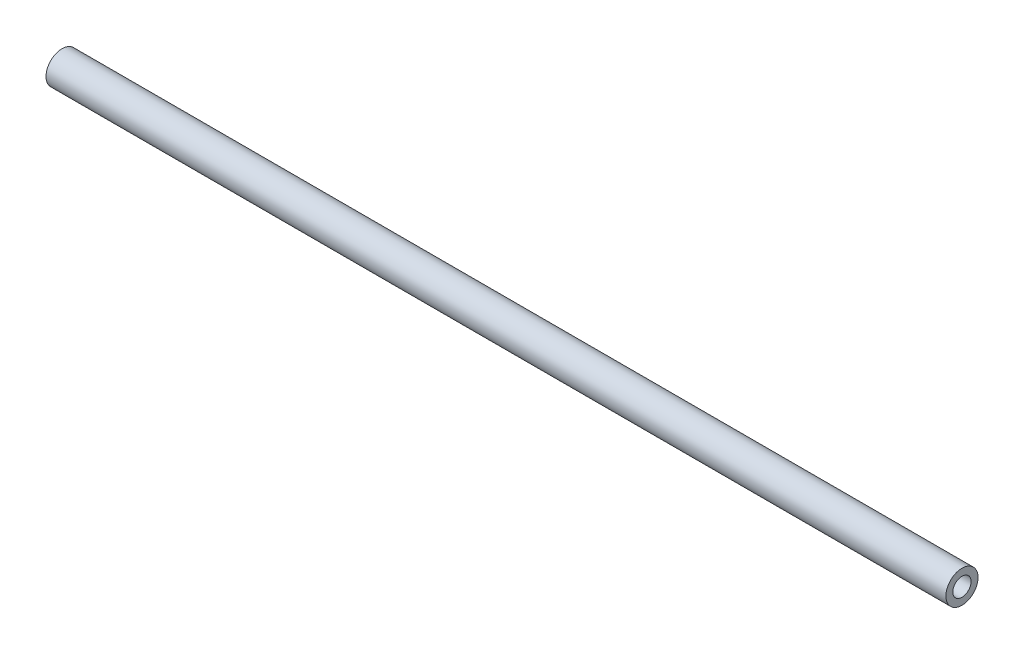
ISO-10303-21;
HEADER;
FILE_DESCRIPTION(('STEP AP214'),'2;1');
FILE_NAME('part.step','',(''),(''),'','','');
FILE_SCHEMA(('AUTOMOTIVE_DESIGN { 1 0 10303 214 1 1 1 1 }'));
ENDSEC;
DATA;
#1=APPLICATION_CONTEXT('core data for automotive mechanical design processes');
#2=APPLICATION_PROTOCOL_DEFINITION('international standard','automotive_design',2000,#1);
#3=PRODUCT_CONTEXT('',#1,'mechanical');
#4=PRODUCT('Part','Part','',(#3));
#5=PRODUCT_RELATED_PRODUCT_CATEGORY('part','',(#4));
#6=PRODUCT_DEFINITION_FORMATION('','',#4);
#7=PRODUCT_DEFINITION_CONTEXT('part definition',#1,'design');
#8=PRODUCT_DEFINITION('design','',#6,#7);
#9=PRODUCT_DEFINITION_SHAPE('','',#8);
#10=(LENGTH_UNIT() NAMED_UNIT(*) SI_UNIT(.MILLI.,.METRE.));
#11=(NAMED_UNIT(*) PLANE_ANGLE_UNIT() SI_UNIT($,.RADIAN.));
#12=(NAMED_UNIT(*) SI_UNIT($,.STERADIAN.) SOLID_ANGLE_UNIT());
#13=UNCERTAINTY_MEASURE_WITH_UNIT(LENGTH_MEASURE(1.E-05),#10,'distance_accuracy_value','');
#14=(GEOMETRIC_REPRESENTATION_CONTEXT(3) GLOBAL_UNCERTAINTY_ASSIGNED_CONTEXT((#13)) GLOBAL_UNIT_ASSIGNED_CONTEXT((#10,
#11,#12)) REPRESENTATION_CONTEXT('',''));
#15=CARTESIAN_POINT('',(0.,0.,0.));
#16=DIRECTION('',(0.,0.,1.));
#17=DIRECTION('',(1.,0.,0.));
#18=AXIS2_PLACEMENT_3D('',#15,#16,#17);
#19=CARTESIAN_POINT('',(-66.675,2.38124999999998,0.));
#20=DIRECTION('',(1.,0.,0.));
#21=DIRECTION('',(0.,0.,-1.));
#22=AXIS2_PLACEMENT_3D('',#19,#20,#21);
#23=PLANE('',#22);
#24=CARTESIAN_POINT('',(-66.675,0.,0.));
#25=DIRECTION('',(-1.,0.,0.));
#26=DIRECTION('',(0.,0.,1.));
#27=AXIS2_PLACEMENT_3D('',#24,#25,#26);
#28=CIRCLE('',#27,1.35255);
#29=CARTESIAN_POINT('',(-66.675,0.,1.35255));
#30=VERTEX_POINT('',#29);
#31=EDGE_CURVE('E60',#30,#30,#28,.T.);
#32=ORIENTED_EDGE('',*,*,#31,.F.);
#33=EDGE_LOOP('',(#32));
#34=FACE_BOUND('',#33,.T.);
#35=CARTESIAN_POINT('',(-66.675,0.,0.));
#36=DIRECTION('',(-1.,0.,0.));
#37=DIRECTION('',(0.,0.,1.));
#38=AXIS2_PLACEMENT_3D('',#35,#36,#37);
#39=CIRCLE('',#38,2.38124999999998);
#40=CARTESIAN_POINT('',(-66.675,0.,2.38124999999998));
#41=VERTEX_POINT('',#40);
#42=EDGE_CURVE('E44',#41,#41,#39,.T.);
#43=ORIENTED_EDGE('',*,*,#42,.T.);
#44=EDGE_LOOP('',(#43));
#45=FACE_BOUND('',#44,.T.);
#46=ADVANCED_FACE('F37',(#34,#45),#23,.F.);
#47=CARTESIAN_POINT('',(66.675,0.,0.));
#48=DIRECTION('',(-1.,0.,0.));
#49=DIRECTION('',(0.,0.,1.));
#50=AXIS2_PLACEMENT_3D('',#47,#48,#49);
#51=PLANE('',#50);
#52=CARTESIAN_POINT('',(66.675,0.,0.));
#53=DIRECTION('',(1.,0.,0.));
#54=DIRECTION('',(0.,0.,-1.));
#55=AXIS2_PLACEMENT_3D('',#52,#53,#54);
#56=CIRCLE('',#55,1.35255);
#57=CARTESIAN_POINT('',(66.675,0.,-1.35255));
#58=VERTEX_POINT('',#57);
#59=EDGE_CURVE('E61',#58,#58,#56,.T.);
#60=ORIENTED_EDGE('',*,*,#59,.F.);
#61=EDGE_LOOP('',(#60));
#62=FACE_BOUND('',#61,.T.);
#63=CARTESIAN_POINT('',(66.675,0.,0.));
#64=DIRECTION('',(-1.,0.,0.));
#65=DIRECTION('',(0.,0.,1.));
#66=AXIS2_PLACEMENT_3D('',#63,#64,#65);
#67=CIRCLE('',#66,2.38125000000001);
#68=CARTESIAN_POINT('',(66.675,0.,2.38125000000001));
#69=VERTEX_POINT('',#68);
#70=EDGE_CURVE('E11',#69,#69,#67,.T.);
#71=ORIENTED_EDGE('',*,*,#70,.F.);
#72=EDGE_LOOP('',(#71));
#73=FACE_BOUND('',#72,.T.);
#74=ADVANCED_FACE('F78',(#62,#73),#51,.F.);
#75=CARTESIAN_POINT('',(0.,0.,0.));
#76=DIRECTION('',(-1.,0.,0.));
#77=DIRECTION('',(0.,0.,1.));
#78=AXIS2_PLACEMENT_3D('',#75,#76,#77);
#79=CYLINDRICAL_SURFACE('',#78,2.38125);
#80=ORIENTED_EDGE('',*,*,#42,.F.);
#81=EDGE_LOOP('',(#80));
#82=FACE_BOUND('',#81,.T.);
#83=ORIENTED_EDGE('',*,*,#70,.T.);
#84=EDGE_LOOP('',(#83));
#85=FACE_BOUND('',#84,.T.);
#86=ADVANCED_FACE('F74',(#82,#85),#79,.T.);
#87=CARTESIAN_POINT('',(-53.975,0.,0.));
#88=DIRECTION('',(-1.,0.,0.));
#89=DIRECTION('',(0.,0.,1.));
#90=AXIS2_PLACEMENT_3D('',#87,#88,#89);
#91=CONICAL_SURFACE('',#90,1.35255,1.02974425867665);
#92=CARTESIAN_POINT('',(-53.1623059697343,0.,0.));
#93=VERTEX_POINT('',#92);
#94=VERTEX_LOOP('',#93);
#95=FACE_BOUND('',#94,.T.);
#96=CARTESIAN_POINT('',(-53.975,0.,0.));
#97=DIRECTION('',(-1.,0.,0.));
#98=DIRECTION('',(0.,0.,1.));
#99=AXIS2_PLACEMENT_3D('',#96,#97,#98);
#100=CIRCLE('',#99,1.35255);
#101=CARTESIAN_POINT('',(-53.975,0.,1.35255));
#102=VERTEX_POINT('',#101);
#103=EDGE_CURVE('E64',#102,#102,#100,.T.);
#104=ORIENTED_EDGE('',*,*,#103,.T.);
#105=EDGE_LOOP('',(#104));
#106=FACE_BOUND('',#105,.T.);
#107=ADVANCED_FACE('F77',(#95,#106),#91,.F.);
#108=CARTESIAN_POINT('',(-66.675,0.,0.));
#109=DIRECTION('',(-1.,0.,0.));
#110=DIRECTION('',(0.,0.,1.));
#111=AXIS2_PLACEMENT_3D('',#108,#109,#110);
#112=CYLINDRICAL_SURFACE('',#111,1.35255);
#113=ORIENTED_EDGE('',*,*,#103,.F.);
#114=EDGE_LOOP('',(#113));
#115=FACE_BOUND('',#114,.T.);
#116=ORIENTED_EDGE('',*,*,#31,.T.);
#117=EDGE_LOOP('',(#116));
#118=FACE_BOUND('',#117,.T.);
#119=ADVANCED_FACE('F54',(#115,#118),#112,.F.);
#120=CARTESIAN_POINT('',(53.975,0.,0.));
#121=DIRECTION('',(1.,0.,0.));
#122=DIRECTION('',(0.,0.,-1.));
#123=AXIS2_PLACEMENT_3D('',#120,#121,#122);
#124=CONICAL_SURFACE('',#123,1.35255,1.02974425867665);
#125=CARTESIAN_POINT('',(53.1623059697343,0.,0.));
#126=VERTEX_POINT('',#125);
#127=VERTEX_LOOP('',#126);
#128=FACE_BOUND('',#127,.T.);
#129=CARTESIAN_POINT('',(53.975,0.,0.));
#130=DIRECTION('',(1.,0.,0.));
#131=DIRECTION('',(0.,0.,-1.));
#132=AXIS2_PLACEMENT_3D('',#129,#130,#131);
#133=CIRCLE('',#132,1.35255);
#134=CARTESIAN_POINT('',(53.975,0.,-1.35255));
#135=VERTEX_POINT('',#134);
#136=EDGE_CURVE('E58',#135,#135,#133,.T.);
#137=ORIENTED_EDGE('',*,*,#136,.T.);
#138=EDGE_LOOP('',(#137));
#139=FACE_BOUND('',#138,.T.);
#140=ADVANCED_FACE('F50',(#128,#139),#124,.F.);
#141=CARTESIAN_POINT('',(66.675,0.,0.));
#142=DIRECTION('',(1.,0.,0.));
#143=DIRECTION('',(0.,0.,-1.));
#144=AXIS2_PLACEMENT_3D('',#141,#142,#143);
#145=CYLINDRICAL_SURFACE('',#144,1.35255);
#146=ORIENTED_EDGE('',*,*,#136,.F.);
#147=EDGE_LOOP('',(#146));
#148=FACE_BOUND('',#147,.T.);
#149=ORIENTED_EDGE('',*,*,#59,.T.);
#150=EDGE_LOOP('',(#149));
#151=FACE_BOUND('',#150,.T.);
#152=ADVANCED_FACE('F53',(#148,#151),#145,.F.);
#153=CLOSED_SHELL('',(#46,#74,#86,#107,#119,#140,#152));
#154=MANIFOLD_SOLID_BREP('B2',#153);
#155=ADVANCED_BREP_SHAPE_REPRESENTATION('',(#18,#154),#14);
#156=SHAPE_DEFINITION_REPRESENTATION(#9,#155);
ENDSEC;
END-ISO-10303-21;
